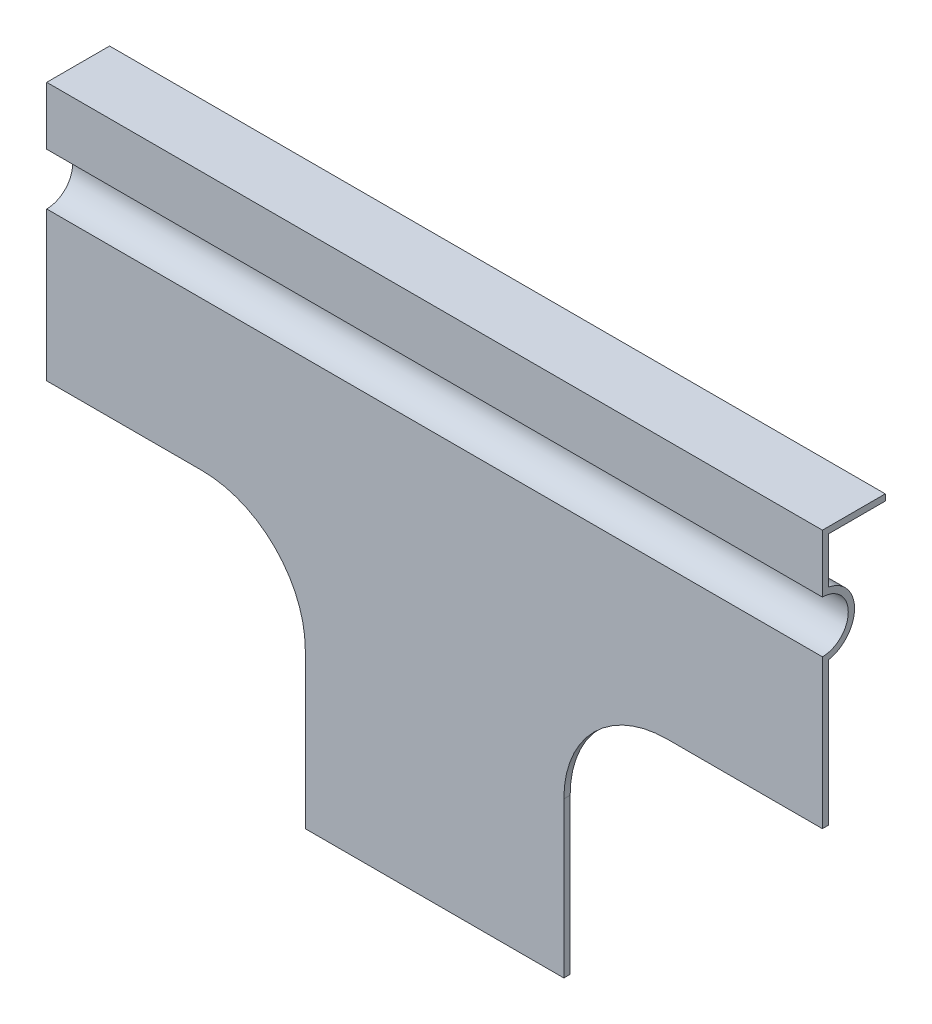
ISO-10303-21;
HEADER;
FILE_DESCRIPTION(('STEP AP214'),'2;1');
FILE_NAME('part.step','',(''),(''),'','','');
FILE_SCHEMA(('AUTOMOTIVE_DESIGN { 1 0 10303 214 1 1 1 1 }'));
ENDSEC;
DATA;
#1=APPLICATION_CONTEXT('core data for automotive mechanical design processes');
#2=APPLICATION_PROTOCOL_DEFINITION('international standard','automotive_design',2000,#1);
#3=PRODUCT_CONTEXT('',#1,'mechanical');
#4=PRODUCT('Part','Part','',(#3));
#5=PRODUCT_RELATED_PRODUCT_CATEGORY('part','',(#4));
#6=PRODUCT_DEFINITION_FORMATION('','',#4);
#7=PRODUCT_DEFINITION_CONTEXT('part definition',#1,'design');
#8=PRODUCT_DEFINITION('design','',#6,#7);
#9=PRODUCT_DEFINITION_SHAPE('','',#8);
#10=(LENGTH_UNIT() NAMED_UNIT(*) SI_UNIT(.MILLI.,.METRE.));
#11=(NAMED_UNIT(*) PLANE_ANGLE_UNIT() SI_UNIT($,.RADIAN.));
#12=(NAMED_UNIT(*) SI_UNIT($,.STERADIAN.) SOLID_ANGLE_UNIT());
#13=UNCERTAINTY_MEASURE_WITH_UNIT(LENGTH_MEASURE(1.E-05),#10,'distance_accuracy_value','');
#14=(GEOMETRIC_REPRESENTATION_CONTEXT(3) GLOBAL_UNCERTAINTY_ASSIGNED_CONTEXT((#13)) GLOBAL_UNIT_ASSIGNED_CONTEXT((#10,
#11,#12)) REPRESENTATION_CONTEXT('',''));
#15=CARTESIAN_POINT('',(0.,0.,0.));
#16=DIRECTION('',(0.,0.,1.));
#17=DIRECTION('',(1.,0.,0.));
#18=AXIS2_PLACEMENT_3D('',#15,#16,#17);
#19=CARTESIAN_POINT('',(150.,-57.3206995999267,0.));
#20=DIRECTION('',(0.,1.,0.));
#21=DIRECTION('',(0.,0.,1.));
#22=AXIS2_PLACEMENT_3D('',#19,#20,#21);
#23=PLANE('',#22);
#24=DIRECTION('',(0.,0.,1.));
#25=VECTOR('',#24,1.);
#26=CARTESIAN_POINT('',(50.,-57.3206995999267,-240.751495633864));
#27=LINE('',#26,#25);
#28=CARTESIAN_POINT('',(50.,-57.3206995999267,-1.214));
#29=VERTEX_POINT('',#28);
#30=CARTESIAN_POINT('',(50.,-57.3206995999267,0.));
#31=VERTEX_POINT('',#30);
#32=EDGE_CURVE('E192',#29,#31,#27,.T.);
#33=ORIENTED_EDGE('',*,*,#32,.F.);
#34=DIRECTION('',(-1.,0.,0.));
#35=VECTOR('',#34,1.);
#36=CARTESIAN_POINT('',(150.,-57.3206995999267,-1.214));
#37=LINE('',#36,#35);
#38=CARTESIAN_POINT('',(100.,-57.3206995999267,-1.21399999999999));
#39=VERTEX_POINT('',#38);
#40=EDGE_CURVE('E182',#39,#29,#37,.T.);
#41=ORIENTED_EDGE('',*,*,#40,.F.);
#42=DIRECTION('',(0.,0.,1.));
#43=VECTOR('',#42,1.);
#44=CARTESIAN_POINT('',(100.,-57.3206995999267,-240.751495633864));
#45=LINE('',#44,#43);
#46=CARTESIAN_POINT('',(100.,-57.3206995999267,0.));
#47=VERTEX_POINT('',#46);
#48=EDGE_CURVE('E195',#39,#47,#45,.T.);
#49=ORIENTED_EDGE('',*,*,#48,.T.);
#50=DIRECTION('',(-1.,0.,0.));
#51=VECTOR('',#50,1.);
#52=CARTESIAN_POINT('',(150.,-57.3206995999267,0.));
#53=LINE('',#52,#51);
#54=EDGE_CURVE('E261',#47,#31,#53,.T.);
#55=ORIENTED_EDGE('',*,*,#54,.T.);
#56=EDGE_LOOP('',(#33,#41,#49,#55));
#57=FACE_BOUND('',#56,.T.);
#58=ADVANCED_FACE('F31',(#57),#23,.F.);
#59=CARTESIAN_POINT('',(150.,42.6793004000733,-12.1569949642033));
#60=DIRECTION('',(0.,0.,1.));
#61=DIRECTION('',(1.,0.,0.));
#62=AXIS2_PLACEMENT_3D('',#59,#60,#61);
#63=PLANE('',#62);
#64=DIRECTION('',(0.,1.,0.));
#65=VECTOR('',#64,1.);
#66=CARTESIAN_POINT('',(0.,42.6793004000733,-12.1569949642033));
#67=LINE('',#66,#65);
#68=CARTESIAN_POINT('',(0.,41.4653004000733,-12.1569949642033));
#69=VERTEX_POINT('',#68);
#70=CARTESIAN_POINT('',(0.,42.6793004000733,-12.1569949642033));
#71=VERTEX_POINT('',#70);
#72=EDGE_CURVE('E214',#69,#71,#67,.T.);
#73=ORIENTED_EDGE('',*,*,#72,.T.);
#74=DIRECTION('',(-1.,0.,0.));
#75=VECTOR('',#74,1.);
#76=CARTESIAN_POINT('',(150.,42.6793004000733,-12.1569949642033));
#77=LINE('',#76,#75);
#78=CARTESIAN_POINT('',(150.,42.6793004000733,-12.1569949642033));
#79=VERTEX_POINT('',#78);
#80=EDGE_CURVE('E165',#79,#71,#77,.T.);
#81=ORIENTED_EDGE('',*,*,#80,.F.);
#82=DIRECTION('',(0.,1.,0.));
#83=VECTOR('',#82,1.);
#84=CARTESIAN_POINT('',(150.,42.6793004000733,-12.1569949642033));
#85=LINE('',#84,#83);
#86=CARTESIAN_POINT('',(150.,41.4653004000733,-12.1569949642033));
#87=VERTEX_POINT('',#86);
#88=EDGE_CURVE('E215',#87,#79,#85,.T.);
#89=ORIENTED_EDGE('',*,*,#88,.F.);
#90=DIRECTION('',(-1.,0.,0.));
#91=VECTOR('',#90,1.);
#92=CARTESIAN_POINT('',(150.,41.4653004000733,-12.1569949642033));
#93=LINE('',#92,#91);
#94=EDGE_CURVE('E236',#87,#69,#93,.T.);
#95=ORIENTED_EDGE('',*,*,#94,.T.);
#96=EDGE_LOOP('',(#73,#81,#89,#95));
#97=FACE_BOUND('',#96,.T.);
#98=ADVANCED_FACE('F33',(#97),#63,.F.);
#99=CARTESIAN_POINT('',(150.,42.6793004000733,-12.1569949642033));
#100=DIRECTION('',(0.,-1.,0.));
#101=DIRECTION('',(0.,0.,-1.));
#102=AXIS2_PLACEMENT_3D('',#99,#100,#101);
#103=PLANE('',#102);
#104=DIRECTION('',(0.,0.,1.));
#105=VECTOR('',#104,1.);
#106=CARTESIAN_POINT('',(0.,42.6793004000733,-12.1569949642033));
#107=LINE('',#106,#105);
#108=CARTESIAN_POINT('',(0.,42.6793004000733,0.));
#109=VERTEX_POINT('',#108);
#110=EDGE_CURVE('E239',#71,#109,#107,.T.);
#111=ORIENTED_EDGE('',*,*,#110,.T.);
#112=DIRECTION('',(-1.,0.,0.));
#113=VECTOR('',#112,1.);
#114=CARTESIAN_POINT('',(150.,42.6793004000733,0.));
#115=LINE('',#114,#113);
#116=CARTESIAN_POINT('',(150.,42.6793004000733,0.));
#117=VERTEX_POINT('',#116);
#118=EDGE_CURVE('E171',#117,#109,#115,.T.);
#119=ORIENTED_EDGE('',*,*,#118,.F.);
#120=DIRECTION('',(0.,0.,1.));
#121=VECTOR('',#120,1.);
#122=CARTESIAN_POINT('',(150.,42.6793004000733,-12.1569949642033));
#123=LINE('',#122,#121);
#124=EDGE_CURVE('E218',#79,#117,#123,.T.);
#125=ORIENTED_EDGE('',*,*,#124,.F.);
#126=ORIENTED_EDGE('',*,*,#80,.T.);
#127=EDGE_LOOP('',(#111,#119,#125,#126));
#128=FACE_BOUND('',#127,.T.);
#129=ADVANCED_FACE('F290',(#128),#103,.F.);
#130=CARTESIAN_POINT('',(150.,42.6793004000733,0.));
#131=DIRECTION('',(0.,0.,-1.));
#132=DIRECTION('',(0.,1.,0.));
#133=AXIS2_PLACEMENT_3D('',#130,#131,#132);
#134=PLANE('',#133);
#135=DIRECTION('',(0.,-1.,0.));
#136=VECTOR('',#135,1.);
#137=CARTESIAN_POINT('',(0.,42.6793004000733,0.));
#138=LINE('',#137,#136);
#139=CARTESIAN_POINT('',(0.,31.4653004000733,0.));
#140=VERTEX_POINT('',#139);
#141=EDGE_CURVE('E241',#109,#140,#138,.T.);
#142=ORIENTED_EDGE('',*,*,#141,.T.);
#143=DIRECTION('',(-1.,0.,0.));
#144=VECTOR('',#143,1.);
#145=CARTESIAN_POINT('',(150.,31.4653004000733,0.));
#146=LINE('',#145,#144);
#147=CARTESIAN_POINT('',(150.,31.4653004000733,0.));
#148=VERTEX_POINT('',#147);
#149=EDGE_CURVE('E267',#148,#140,#146,.T.);
#150=ORIENTED_EDGE('',*,*,#149,.F.);
#151=DIRECTION('',(0.,-1.,0.));
#152=VECTOR('',#151,1.);
#153=CARTESIAN_POINT('',(150.,42.6793004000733,0.));
#154=LINE('',#153,#152);
#155=EDGE_CURVE('E221',#117,#148,#154,.T.);
#156=ORIENTED_EDGE('',*,*,#155,.F.);
#157=ORIENTED_EDGE('',*,*,#118,.T.);
#158=EDGE_LOOP('',(#142,#150,#156,#157));
#159=FACE_BOUND('',#158,.T.);
#160=ADVANCED_FACE('F274',(#159),#134,.F.);
#161=CARTESIAN_POINT('',(150.,26.4653004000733,0.));
#162=DIRECTION('',(-1.,0.,0.));
#163=DIRECTION('',(0.,0.,1.));
#164=AXIS2_PLACEMENT_3D('',#161,#162,#163);
#165=CYLINDRICAL_SURFACE('',#164,5.);
#166=CARTESIAN_POINT('',(0.,26.4653004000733,0.));
#167=DIRECTION('',(-1.,0.,0.));
#168=DIRECTION('',(0.,0.,1.));
#169=AXIS2_PLACEMENT_3D('',#166,#167,#168);
#170=CIRCLE('',#169,5.);
#171=CARTESIAN_POINT('',(0.,21.4653004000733,0.));
#172=VERTEX_POINT('',#171);
#173=EDGE_CURVE('E243',#140,#172,#170,.T.);
#174=ORIENTED_EDGE('',*,*,#173,.T.);
#175=DIRECTION('',(-1.,0.,0.));
#176=VECTOR('',#175,1.);
#177=CARTESIAN_POINT('',(150.,21.4653004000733,0.));
#178=LINE('',#177,#176);
#179=CARTESIAN_POINT('',(150.,21.4653004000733,0.));
#180=VERTEX_POINT('',#179);
#181=EDGE_CURVE('E264',#180,#172,#178,.T.);
#182=ORIENTED_EDGE('',*,*,#181,.F.);
#183=CARTESIAN_POINT('',(150.,26.4653004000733,0.));
#184=DIRECTION('',(-1.,0.,0.));
#185=DIRECTION('',(0.,0.,1.));
#186=AXIS2_PLACEMENT_3D('',#183,#184,#185);
#187=CIRCLE('',#186,5.);
#188=EDGE_CURVE('E223',#148,#180,#187,.T.);
#189=ORIENTED_EDGE('',*,*,#188,.F.);
#190=ORIENTED_EDGE('',*,*,#149,.T.);
#191=EDGE_LOOP('',(#174,#182,#189,#190));
#192=FACE_BOUND('',#191,.T.);
#193=ADVANCED_FACE('F281',(#192),#165,.F.);
#194=CARTESIAN_POINT('',(150.,21.4653004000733,0.));
#195=DIRECTION('',(0.,0.,-1.));
#196=DIRECTION('',(0.,1.,0.));
#197=AXIS2_PLACEMENT_3D('',#194,#195,#196);
#198=PLANE('',#197);
#199=DIRECTION('',(0.,-1.,0.));
#200=VECTOR('',#199,1.);
#201=CARTESIAN_POINT('',(0.,21.4653004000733,0.));
#202=LINE('',#201,#200);
#203=CARTESIAN_POINT('',(0.,-7.32069959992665,0.));
#204=VERTEX_POINT('',#203);
#205=EDGE_CURVE('E152',#172,#204,#202,.T.);
#206=ORIENTED_EDGE('',*,*,#205,.T.);
#207=DIRECTION('',(1.,0.,0.));
#208=VECTOR('',#207,1.);
#209=CARTESIAN_POINT('',(150.,-7.32069959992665,0.));
#210=LINE('',#209,#208);
#211=CARTESIAN_POINT('',(30.,-7.32069959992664,0.));
#212=VERTEX_POINT('',#211);
#213=EDGE_CURVE('E46',#204,#212,#210,.T.);
#214=ORIENTED_EDGE('',*,*,#213,.T.);
#215=CARTESIAN_POINT('',(30.,-27.3206995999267,0.));
#216=DIRECTION('',(0.,0.,-1.));
#217=DIRECTION('',(0.,1.,0.));
#218=AXIS2_PLACEMENT_3D('',#215,#216,#217);
#219=CIRCLE('',#218,20.);
#220=CARTESIAN_POINT('',(50.,-27.3206995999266,0.));
#221=VERTEX_POINT('',#220);
#222=EDGE_CURVE('E50',#212,#221,#219,.T.);
#223=ORIENTED_EDGE('',*,*,#222,.T.);
#224=DIRECTION('',(0.,-1.,0.));
#225=VECTOR('',#224,1.);
#226=CARTESIAN_POINT('',(50.,21.4653004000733,0.));
#227=LINE('',#226,#225);
#228=EDGE_CURVE('E191',#221,#31,#227,.T.);
#229=ORIENTED_EDGE('',*,*,#228,.T.);
#230=ORIENTED_EDGE('',*,*,#54,.F.);
#231=DIRECTION('',(0.,1.,0.));
#232=VECTOR('',#231,1.);
#233=CARTESIAN_POINT('',(100.,21.4653004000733,0.));
#234=LINE('',#233,#232);
#235=CARTESIAN_POINT('',(100.,-27.3206995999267,0.));
#236=VERTEX_POINT('',#235);
#237=EDGE_CURVE('E209',#47,#236,#234,.T.);
#238=ORIENTED_EDGE('',*,*,#237,.T.);
#239=CARTESIAN_POINT('',(120.,-27.3206995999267,0.));
#240=DIRECTION('',(0.,0.,-1.));
#241=DIRECTION('',(0.,1.,0.));
#242=AXIS2_PLACEMENT_3D('',#239,#240,#241);
#243=CIRCLE('',#242,20.);
#244=CARTESIAN_POINT('',(120.,-7.32069959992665,0.));
#245=VERTEX_POINT('',#244);
#246=EDGE_CURVE('E206',#236,#245,#243,.T.);
#247=ORIENTED_EDGE('',*,*,#246,.T.);
#248=DIRECTION('',(1.,0.,0.));
#249=VECTOR('',#248,1.);
#250=CARTESIAN_POINT('',(150.,-7.32069959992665,0.));
#251=LINE('',#250,#249);
#252=CARTESIAN_POINT('',(150.,-7.32069959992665,0.));
#253=VERTEX_POINT('',#252);
#254=EDGE_CURVE('E203',#245,#253,#251,.T.);
#255=ORIENTED_EDGE('',*,*,#254,.T.);
#256=DIRECTION('',(0.,-1.,0.));
#257=VECTOR('',#256,1.);
#258=CARTESIAN_POINT('',(150.,21.4653004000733,0.));
#259=LINE('',#258,#257);
#260=EDGE_CURVE('E225',#180,#253,#259,.T.);
#261=ORIENTED_EDGE('',*,*,#260,.F.);
#262=ORIENTED_EDGE('',*,*,#181,.T.);
#263=EDGE_LOOP('',(#206,#214,#223,#229,#230,#238,#247,#255,#261,#262));
#264=FACE_BOUND('',#263,.T.);
#265=ADVANCED_FACE('F284',(#264),#198,.F.);
#266=CARTESIAN_POINT('',(150.,20.3710408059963,-1.214));
#267=DIRECTION('',(0.,0.,1.));
#268=DIRECTION('',(0.,-1.,0.));
#269=AXIS2_PLACEMENT_3D('',#266,#267,#268);
#270=PLANE('',#269);
#271=CARTESIAN_POINT('',(30.,-27.3206995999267,-1.21399999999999));
#272=DIRECTION('',(0.,0.,1.));
#273=DIRECTION('',(0.,-1.,0.));
#274=AXIS2_PLACEMENT_3D('',#271,#272,#273);
#275=CIRCLE('',#274,20.);
#276=CARTESIAN_POINT('',(50.,-27.3206995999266,-1.214));
#277=VERTEX_POINT('',#276);
#278=CARTESIAN_POINT('',(30.,-7.32069959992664,-1.21399999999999));
#279=VERTEX_POINT('',#278);
#280=EDGE_CURVE('E11',#277,#279,#275,.T.);
#281=ORIENTED_EDGE('',*,*,#280,.T.);
#282=DIRECTION('',(-1.,0.,0.));
#283=VECTOR('',#282,1.);
#284=CARTESIAN_POINT('',(150.,-7.32069959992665,-1.214));
#285=LINE('',#284,#283);
#286=CARTESIAN_POINT('',(0.,-7.32069959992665,-1.21399999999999));
#287=VERTEX_POINT('',#286);
#288=EDGE_CURVE('E155',#279,#287,#285,.T.);
#289=ORIENTED_EDGE('',*,*,#288,.T.);
#290=DIRECTION('',(0.,1.,0.));
#291=VECTOR('',#290,1.);
#292=CARTESIAN_POINT('',(0.,20.3710408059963,-1.214));
#293=LINE('',#292,#291);
#294=CARTESIAN_POINT('',(0.,20.3710408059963,-1.214));
#295=VERTEX_POINT('',#294);
#296=EDGE_CURVE('E141',#287,#295,#293,.T.);
#297=ORIENTED_EDGE('',*,*,#296,.T.);
#298=DIRECTION('',(-1.,0.,0.));
#299=VECTOR('',#298,1.);
#300=CARTESIAN_POINT('',(150.,20.3710408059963,-1.214));
#301=LINE('',#300,#299);
#302=CARTESIAN_POINT('',(150.,20.3710408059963,-1.214));
#303=VERTEX_POINT('',#302);
#304=EDGE_CURVE('E258',#303,#295,#301,.T.);
#305=ORIENTED_EDGE('',*,*,#304,.F.);
#306=DIRECTION('',(0.,1.,0.));
#307=VECTOR('',#306,1.);
#308=CARTESIAN_POINT('',(150.,20.3710408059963,-1.214));
#309=LINE('',#308,#307);
#310=CARTESIAN_POINT('',(150.,-7.32069959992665,-1.214));
#311=VERTEX_POINT('',#310);
#312=EDGE_CURVE('E228',#311,#303,#309,.T.);
#313=ORIENTED_EDGE('',*,*,#312,.F.);
#314=DIRECTION('',(-1.,0.,0.));
#315=VECTOR('',#314,1.);
#316=CARTESIAN_POINT('',(150.,-7.32069959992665,-1.214));
#317=LINE('',#316,#315);
#318=CARTESIAN_POINT('',(120.,-7.32069959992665,-1.21399999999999));
#319=VERTEX_POINT('',#318);
#320=EDGE_CURVE('E200',#311,#319,#317,.T.);
#321=ORIENTED_EDGE('',*,*,#320,.T.);
#322=CARTESIAN_POINT('',(120.,-27.3206995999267,-1.21399999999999));
#323=DIRECTION('',(0.,0.,1.));
#324=DIRECTION('',(0.,-1.,0.));
#325=AXIS2_PLACEMENT_3D('',#322,#323,#324);
#326=CIRCLE('',#325,20.);
#327=CARTESIAN_POINT('',(100.,-27.3206995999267,-1.21399999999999));
#328=VERTEX_POINT('',#327);
#329=EDGE_CURVE('E168',#319,#328,#326,.T.);
#330=ORIENTED_EDGE('',*,*,#329,.T.);
#331=DIRECTION('',(0.,-1.,0.));
#332=VECTOR('',#331,1.);
#333=CARTESIAN_POINT('',(100.,20.3710408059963,-1.214));
#334=LINE('',#333,#332);
#335=EDGE_CURVE('E177',#328,#39,#334,.T.);
#336=ORIENTED_EDGE('',*,*,#335,.T.);
#337=ORIENTED_EDGE('',*,*,#40,.T.);
#338=DIRECTION('',(0.,1.,0.));
#339=VECTOR('',#338,1.);
#340=CARTESIAN_POINT('',(50.,20.3710408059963,-1.214));
#341=LINE('',#340,#339);
#342=EDGE_CURVE('E39',#29,#277,#341,.T.);
#343=ORIENTED_EDGE('',*,*,#342,.T.);
#344=EDGE_LOOP('',(#281,#289,#297,#305,#313,#321,#330,#336,#337,#343));
#345=FACE_BOUND('',#344,.T.);
#346=ADVANCED_FACE('F156',(#345),#270,.F.);
#347=CARTESIAN_POINT('',(150.,26.4653004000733,0.));
#348=DIRECTION('',(-1.,0.,0.));
#349=DIRECTION('',(0.,0.,1.));
#350=AXIS2_PLACEMENT_3D('',#347,#348,#349);
#351=CYLINDRICAL_SURFACE('',#350,6.214);
#352=CARTESIAN_POINT('',(0.,26.4653004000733,0.));
#353=DIRECTION('',(1.,0.,0.));
#354=DIRECTION('',(0.,0.,1.));
#355=AXIS2_PLACEMENT_3D('',#352,#353,#354);
#356=CIRCLE('',#355,6.214);
#357=CARTESIAN_POINT('',(0.,32.5595599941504,-1.214));
#358=VERTEX_POINT('',#357);
#359=EDGE_CURVE('E148',#295,#358,#356,.T.);
#360=ORIENTED_EDGE('',*,*,#359,.T.);
#361=DIRECTION('',(-1.,0.,0.));
#362=VECTOR('',#361,1.);
#363=CARTESIAN_POINT('',(150.,32.5595599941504,-1.214));
#364=LINE('',#363,#362);
#365=CARTESIAN_POINT('',(150.,32.5595599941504,-1.214));
#366=VERTEX_POINT('',#365);
#367=EDGE_CURVE('E255',#366,#358,#364,.T.);
#368=ORIENTED_EDGE('',*,*,#367,.F.);
#369=CARTESIAN_POINT('',(150.,26.4653004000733,0.));
#370=DIRECTION('',(1.,0.,0.));
#371=DIRECTION('',(0.,0.,1.));
#372=AXIS2_PLACEMENT_3D('',#369,#370,#371);
#373=CIRCLE('',#372,6.214);
#374=EDGE_CURVE('E230',#303,#366,#373,.T.);
#375=ORIENTED_EDGE('',*,*,#374,.F.);
#376=ORIENTED_EDGE('',*,*,#304,.T.);
#377=EDGE_LOOP('',(#360,#368,#375,#376));
#378=FACE_BOUND('',#377,.T.);
#379=ADVANCED_FACE('F304',(#378),#351,.T.);
#380=CARTESIAN_POINT('',(150.,41.4653004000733,-1.21400000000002));
#381=DIRECTION('',(0.,0.,1.));
#382=DIRECTION('',(0.,-1.,0.));
#383=AXIS2_PLACEMENT_3D('',#380,#381,#382);
#384=PLANE('',#383);
#385=DIRECTION('',(0.,1.,0.));
#386=VECTOR('',#385,1.);
#387=CARTESIAN_POINT('',(0.,41.4653004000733,-1.21400000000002));
#388=LINE('',#387,#386);
#389=CARTESIAN_POINT('',(0.,41.4653004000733,-1.21400000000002));
#390=VERTEX_POINT('',#389);
#391=EDGE_CURVE('E247',#358,#390,#388,.T.);
#392=ORIENTED_EDGE('',*,*,#391,.T.);
#393=DIRECTION('',(-1.,0.,0.));
#394=VECTOR('',#393,1.);
#395=CARTESIAN_POINT('',(150.,41.4653004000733,-1.21400000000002));
#396=LINE('',#395,#394);
#397=CARTESIAN_POINT('',(150.,41.4653004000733,-1.21400000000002));
#398=VERTEX_POINT('',#397);
#399=EDGE_CURVE('E252',#398,#390,#396,.T.);
#400=ORIENTED_EDGE('',*,*,#399,.F.);
#401=DIRECTION('',(0.,1.,0.));
#402=VECTOR('',#401,1.);
#403=CARTESIAN_POINT('',(150.,41.4653004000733,-1.21400000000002));
#404=LINE('',#403,#402);
#405=EDGE_CURVE('E232',#366,#398,#404,.T.);
#406=ORIENTED_EDGE('',*,*,#405,.F.);
#407=ORIENTED_EDGE('',*,*,#367,.T.);
#408=EDGE_LOOP('',(#392,#400,#406,#407));
#409=FACE_BOUND('',#408,.T.);
#410=ADVANCED_FACE('F300',(#409),#384,.F.);
#411=CARTESIAN_POINT('',(150.,41.4653004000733,-12.1569949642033));
#412=DIRECTION('',(0.,1.,0.));
#413=DIRECTION('',(0.,0.,1.));
#414=AXIS2_PLACEMENT_3D('',#411,#412,#413);
#415=PLANE('',#414);
#416=DIRECTION('',(0.,0.,-1.));
#417=VECTOR('',#416,1.);
#418=CARTESIAN_POINT('',(0.,41.4653004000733,-12.1569949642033));
#419=LINE('',#418,#417);
#420=EDGE_CURVE('E219',#390,#69,#419,.T.);
#421=ORIENTED_EDGE('',*,*,#420,.T.);
#422=ORIENTED_EDGE('',*,*,#94,.F.);
#423=DIRECTION('',(0.,0.,-1.));
#424=VECTOR('',#423,1.);
#425=CARTESIAN_POINT('',(150.,41.4653004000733,-12.1569949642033));
#426=LINE('',#425,#424);
#427=EDGE_CURVE('E234',#398,#87,#426,.T.);
#428=ORIENTED_EDGE('',*,*,#427,.F.);
#429=ORIENTED_EDGE('',*,*,#399,.T.);
#430=EDGE_LOOP('',(#421,#422,#428,#429));
#431=FACE_BOUND('',#430,.T.);
#432=ADVANCED_FACE('F295',(#431),#415,.F.);
#433=CARTESIAN_POINT('',(150.,26.4653004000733,0.));
#434=DIRECTION('',(-1.,0.,0.));
#435=DIRECTION('',(0.,0.,1.));
#436=AXIS2_PLACEMENT_3D('',#433,#434,#435);
#437=PLANE('',#436);
#438=ORIENTED_EDGE('',*,*,#260,.T.);
#439=DIRECTION('',(0.,0.,-1.));
#440=VECTOR('',#439,1.);
#441=CARTESIAN_POINT('',(150.,-7.32069959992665,0.));
#442=LINE('',#441,#440);
#443=EDGE_CURVE('E164',#253,#311,#442,.T.);
#444=ORIENTED_EDGE('',*,*,#443,.T.);
#445=ORIENTED_EDGE('',*,*,#312,.T.);
#446=ORIENTED_EDGE('',*,*,#374,.T.);
#447=ORIENTED_EDGE('',*,*,#405,.T.);
#448=ORIENTED_EDGE('',*,*,#427,.T.);
#449=ORIENTED_EDGE('',*,*,#88,.T.);
#450=ORIENTED_EDGE('',*,*,#124,.T.);
#451=ORIENTED_EDGE('',*,*,#155,.T.);
#452=ORIENTED_EDGE('',*,*,#188,.T.);
#453=EDGE_LOOP('',(#438,#444,#445,#446,#447,#448,#449,#450,#451,#452));
#454=FACE_BOUND('',#453,.T.);
#455=ADVANCED_FACE('F286',(#454),#437,.F.);
#456=CARTESIAN_POINT('',(0.,26.4653004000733,0.));
#457=DIRECTION('',(-1.,0.,0.));
#458=DIRECTION('',(0.,0.,1.));
#459=AXIS2_PLACEMENT_3D('',#456,#457,#458);
#460=PLANE('',#459);
#461=DIRECTION('',(0.,0.,-1.));
#462=VECTOR('',#461,1.);
#463=CARTESIAN_POINT('',(0.,-7.32069959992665,0.));
#464=LINE('',#463,#462);
#465=EDGE_CURVE('E146',#204,#287,#464,.T.);
#466=ORIENTED_EDGE('',*,*,#465,.F.);
#467=ORIENTED_EDGE('',*,*,#205,.F.);
#468=ORIENTED_EDGE('',*,*,#173,.F.);
#469=ORIENTED_EDGE('',*,*,#141,.F.);
#470=ORIENTED_EDGE('',*,*,#110,.F.);
#471=ORIENTED_EDGE('',*,*,#72,.F.);
#472=ORIENTED_EDGE('',*,*,#420,.F.);
#473=ORIENTED_EDGE('',*,*,#391,.F.);
#474=ORIENTED_EDGE('',*,*,#359,.F.);
#475=ORIENTED_EDGE('',*,*,#296,.F.);
#476=EDGE_LOOP('',(#466,#467,#468,#469,#470,#471,#472,#473,#474,#475));
#477=FACE_BOUND('',#476,.T.);
#478=ADVANCED_FACE('F143',(#477),#460,.T.);
#479=CARTESIAN_POINT('',(50.,-27.3206995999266,-240.751495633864));
#480=DIRECTION('',(1.,0.,0.));
#481=DIRECTION('',(0.,0.,-1.));
#482=AXIS2_PLACEMENT_3D('',#479,#480,#481);
#483=PLANE('',#482);
#484=ORIENTED_EDGE('',*,*,#228,.F.);
#485=DIRECTION('',(0.,0.,1.));
#486=VECTOR('',#485,1.);
#487=CARTESIAN_POINT('',(50.,-27.3206995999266,-240.751495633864));
#488=LINE('',#487,#486);
#489=EDGE_CURVE('E189',#277,#221,#488,.T.);
#490=ORIENTED_EDGE('',*,*,#489,.F.);
#491=ORIENTED_EDGE('',*,*,#342,.F.);
#492=ORIENTED_EDGE('',*,*,#32,.T.);
#493=EDGE_LOOP('',(#484,#490,#491,#492));
#494=FACE_BOUND('',#493,.T.);
#495=ADVANCED_FACE('F190',(#494),#483,.F.);
#496=CARTESIAN_POINT('',(0.,-7.32069959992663,-240.751495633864));
#497=DIRECTION('',(0.,1.,0.));
#498=DIRECTION('',(0.,0.,1.));
#499=AXIS2_PLACEMENT_3D('',#496,#497,#498);
#500=PLANE('',#499);
#501=ORIENTED_EDGE('',*,*,#213,.F.);
#502=ORIENTED_EDGE('',*,*,#465,.T.);
#503=ORIENTED_EDGE('',*,*,#288,.F.);
#504=DIRECTION('',(0.,0.,1.));
#505=VECTOR('',#504,1.);
#506=CARTESIAN_POINT('',(30.,-7.32069959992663,-240.751495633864));
#507=LINE('',#506,#505);
#508=EDGE_CURVE('E161',#279,#212,#507,.T.);
#509=ORIENTED_EDGE('',*,*,#508,.T.);
#510=EDGE_LOOP('',(#501,#502,#503,#509));
#511=FACE_BOUND('',#510,.T.);
#512=ADVANCED_FACE('F163',(#511),#500,.F.);
#513=CARTESIAN_POINT('',(30.,-27.3206995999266,-240.751495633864));
#514=DIRECTION('',(0.,0.,1.));
#515=DIRECTION('',(0.,-1.,0.));
#516=AXIS2_PLACEMENT_3D('',#513,#514,#515);
#517=CYLINDRICAL_SURFACE('',#516,20.);
#518=ORIENTED_EDGE('',*,*,#222,.F.);
#519=ORIENTED_EDGE('',*,*,#508,.F.);
#520=ORIENTED_EDGE('',*,*,#280,.F.);
#521=ORIENTED_EDGE('',*,*,#489,.T.);
#522=EDGE_LOOP('',(#518,#519,#520,#521));
#523=FACE_BOUND('',#522,.T.);
#524=ADVANCED_FACE('F188',(#523),#517,.F.);
#525=CARTESIAN_POINT('',(100.,-57.3206995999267,-240.751495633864));
#526=DIRECTION('',(-1.,0.,0.));
#527=DIRECTION('',(0.,0.,1.));
#528=AXIS2_PLACEMENT_3D('',#525,#526,#527);
#529=PLANE('',#528);
#530=ORIENTED_EDGE('',*,*,#237,.F.);
#531=ORIENTED_EDGE('',*,*,#48,.F.);
#532=ORIENTED_EDGE('',*,*,#335,.F.);
#533=DIRECTION('',(0.,0.,1.));
#534=VECTOR('',#533,1.);
#535=CARTESIAN_POINT('',(100.,-27.3206995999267,-240.751495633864));
#536=LINE('',#535,#534);
#537=EDGE_CURVE('E311',#328,#236,#536,.T.);
#538=ORIENTED_EDGE('',*,*,#537,.T.);
#539=EDGE_LOOP('',(#530,#531,#532,#538));
#540=FACE_BOUND('',#539,.T.);
#541=ADVANCED_FACE('F319',(#540),#529,.F.);
#542=CARTESIAN_POINT('',(120.,-27.3206995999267,-240.751495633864));
#543=DIRECTION('',(0.,0.,1.));
#544=DIRECTION('',(0.,-1.,0.));
#545=AXIS2_PLACEMENT_3D('',#542,#543,#544);
#546=CYLINDRICAL_SURFACE('',#545,20.);
#547=ORIENTED_EDGE('',*,*,#246,.F.);
#548=ORIENTED_EDGE('',*,*,#537,.F.);
#549=ORIENTED_EDGE('',*,*,#329,.F.);
#550=DIRECTION('',(0.,0.,1.));
#551=VECTOR('',#550,1.);
#552=CARTESIAN_POINT('',(120.,-7.32069959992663,-240.751495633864));
#553=LINE('',#552,#551);
#554=EDGE_CURVE('E309',#319,#245,#553,.T.);
#555=ORIENTED_EDGE('',*,*,#554,.T.);
#556=EDGE_LOOP('',(#547,#548,#549,#555));
#557=FACE_BOUND('',#556,.T.);
#558=ADVANCED_FACE('F321',(#557),#546,.F.);
#559=CARTESIAN_POINT('',(120.,-7.32069959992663,-240.751495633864));
#560=DIRECTION('',(0.,1.,0.));
#561=DIRECTION('',(0.,0.,1.));
#562=AXIS2_PLACEMENT_3D('',#559,#560,#561);
#563=PLANE('',#562);
#564=ORIENTED_EDGE('',*,*,#254,.F.);
#565=ORIENTED_EDGE('',*,*,#554,.F.);
#566=ORIENTED_EDGE('',*,*,#320,.F.);
#567=ORIENTED_EDGE('',*,*,#443,.F.);
#568=EDGE_LOOP('',(#564,#565,#566,#567));
#569=FACE_BOUND('',#568,.T.);
#570=ADVANCED_FACE('F307',(#569),#563,.F.);
#571=CLOSED_SHELL('',(#58,#98,#129,#160,#193,#265,#346,#379,#410,#432,#455,#478,#495,#512,#524,
#541,#558,#570));
#572=MANIFOLD_SOLID_BREP('B2',#571);
#573=ADVANCED_BREP_SHAPE_REPRESENTATION('',(#18,#572),#14);
#574=SHAPE_DEFINITION_REPRESENTATION(#9,#573);
ENDSEC;
END-ISO-10303-21;
